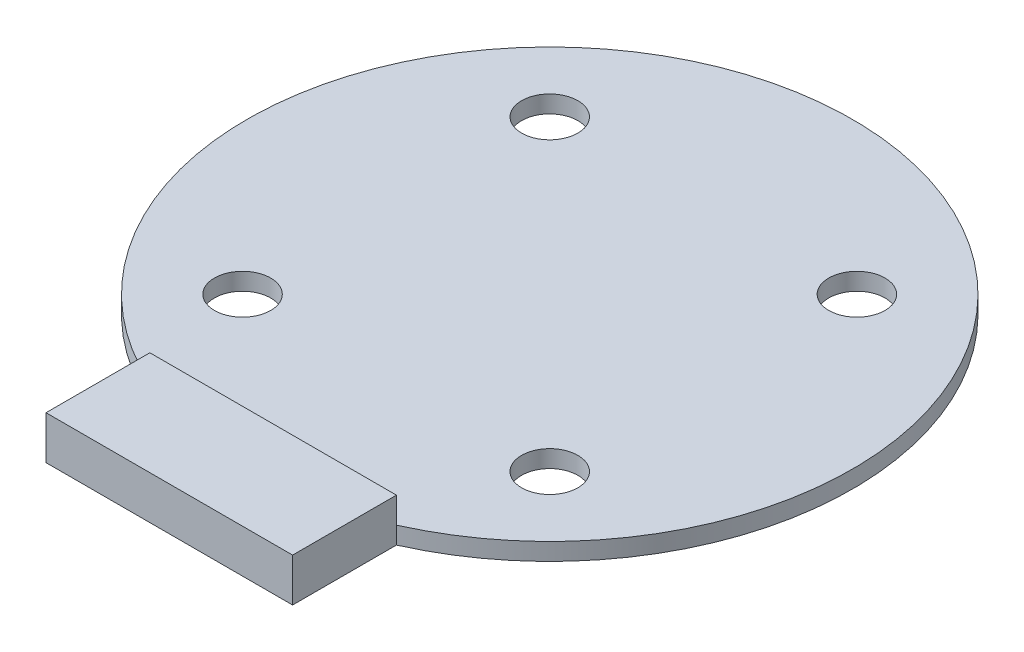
ISO-10303-21;
HEADER;
FILE_DESCRIPTION(('STEP AP214'),'2;1');
FILE_NAME('part.step','',(''),(''),'','','');
FILE_SCHEMA(('AUTOMOTIVE_DESIGN { 1 0 10303 214 1 1 1 1 }'));
ENDSEC;
DATA;
#1=APPLICATION_CONTEXT('core data for automotive mechanical design processes');
#2=APPLICATION_PROTOCOL_DEFINITION('international standard','automotive_design',2000,#1);
#3=PRODUCT_CONTEXT('',#1,'mechanical');
#4=PRODUCT('Part','Part','',(#3));
#5=PRODUCT_RELATED_PRODUCT_CATEGORY('part','',(#4));
#6=PRODUCT_DEFINITION_FORMATION('','',#4);
#7=PRODUCT_DEFINITION_CONTEXT('part definition',#1,'design');
#8=PRODUCT_DEFINITION('design','',#6,#7);
#9=PRODUCT_DEFINITION_SHAPE('','',#8);
#10=(LENGTH_UNIT() NAMED_UNIT(*) SI_UNIT(.MILLI.,.METRE.));
#11=(NAMED_UNIT(*) PLANE_ANGLE_UNIT() SI_UNIT($,.RADIAN.));
#12=(NAMED_UNIT(*) SI_UNIT($,.STERADIAN.) SOLID_ANGLE_UNIT());
#13=UNCERTAINTY_MEASURE_WITH_UNIT(LENGTH_MEASURE(1.E-05),#10,'distance_accuracy_value','');
#14=(GEOMETRIC_REPRESENTATION_CONTEXT(3) GLOBAL_UNCERTAINTY_ASSIGNED_CONTEXT((#13)) GLOBAL_UNIT_ASSIGNED_CONTEXT((#10,
#11,#12)) REPRESENTATION_CONTEXT('',''));
#15=CARTESIAN_POINT('',(0.,0.,0.));
#16=DIRECTION('',(0.,0.,1.));
#17=DIRECTION('',(1.,0.,0.));
#18=AXIS2_PLACEMENT_3D('',#15,#16,#17);
#19=CARTESIAN_POINT('',(0.,2.,0.));
#20=DIRECTION('',(0.,-1.,0.));
#21=DIRECTION('',(0.,0.,-1.));
#22=AXIS2_PLACEMENT_3D('',#19,#20,#21);
#23=CYLINDRICAL_SURFACE('',#22,35.);
#24=DIRECTION('',(0.,1.,0.));
#25=VECTOR('',#24,1.);
#26=CARTESIAN_POINT('',(-14.25,0.,31.9677571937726));
#27=LINE('',#26,#25);
#28=CARTESIAN_POINT('',(-14.25,0.,31.9677571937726));
#29=VERTEX_POINT('',#28);
#30=CARTESIAN_POINT('',(-14.25,2.,31.9677571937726));
#31=VERTEX_POINT('',#30);
#32=EDGE_CURVE('E94',#29,#31,#27,.T.);
#33=ORIENTED_EDGE('',*,*,#32,.T.);
#34=CARTESIAN_POINT('',(0.,2.,0.));
#35=DIRECTION('',(0.,1.,0.));
#36=DIRECTION('',(0.,0.,1.));
#37=AXIS2_PLACEMENT_3D('',#34,#35,#36);
#38=CIRCLE('',#37,35.);
#39=CARTESIAN_POINT('',(14.25,2.,31.9677571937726));
#40=VERTEX_POINT('',#39);
#41=EDGE_CURVE('E11',#40,#31,#38,.T.);
#42=ORIENTED_EDGE('',*,*,#41,.F.);
#43=DIRECTION('',(0.,1.,0.));
#44=VECTOR('',#43,1.);
#45=CARTESIAN_POINT('',(14.25,0.,31.9677571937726));
#46=LINE('',#45,#44);
#47=CARTESIAN_POINT('',(14.25,0.,31.9677571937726));
#48=VERTEX_POINT('',#47);
#49=EDGE_CURVE('E101',#48,#40,#46,.T.);
#50=ORIENTED_EDGE('',*,*,#49,.F.);
#51=CARTESIAN_POINT('',(0.,0.,0.));
#52=DIRECTION('',(0.,1.,0.));
#53=DIRECTION('',(0.,0.,1.));
#54=AXIS2_PLACEMENT_3D('',#51,#52,#53);
#55=CIRCLE('',#54,35.);
#56=EDGE_CURVE('E38',#48,#29,#55,.T.);
#57=ORIENTED_EDGE('',*,*,#56,.T.);
#58=EDGE_LOOP('',(#33,#42,#50,#57));
#59=FACE_BOUND('',#58,.T.);
#60=ADVANCED_FACE('F35',(#59),#23,.T.);
#61=CARTESIAN_POINT('',(0.,2.,0.));
#62=DIRECTION('',(0.,1.,0.));
#63=DIRECTION('',(0.,0.,1.));
#64=AXIS2_PLACEMENT_3D('',#61,#62,#63);
#65=PLANE('',#64);
#66=DIRECTION('',(-1.,0.,0.));
#67=VECTOR('',#66,1.);
#68=CARTESIAN_POINT('',(-14.25,2.,31.9677571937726));
#69=LINE('',#68,#67);
#70=EDGE_CURVE('E100',#40,#31,#69,.T.);
#71=ORIENTED_EDGE('',*,*,#70,.F.);
#72=ORIENTED_EDGE('',*,*,#41,.T.);
#73=EDGE_LOOP('',(#71,#72));
#74=FACE_BOUND('',#73,.T.);
#75=CARTESIAN_POINT('',(-17.75,2.,17.75));
#76=DIRECTION('',(0.,1.,0.));
#77=DIRECTION('',(0.,0.,1.));
#78=AXIS2_PLACEMENT_3D('',#75,#76,#77);
#79=CIRCLE('',#78,3.25);
#80=CARTESIAN_POINT('',(-17.75,2.,21.));
#81=VERTEX_POINT('',#80);
#82=EDGE_CURVE('E126',#81,#81,#79,.T.);
#83=ORIENTED_EDGE('',*,*,#82,.F.);
#84=EDGE_LOOP('',(#83));
#85=FACE_BOUND('',#84,.T.);
#86=CARTESIAN_POINT('',(17.75,2.,17.75));
#87=DIRECTION('',(0.,1.,0.));
#88=DIRECTION('',(0.,0.,1.));
#89=AXIS2_PLACEMENT_3D('',#86,#87,#88);
#90=CIRCLE('',#89,3.25);
#91=CARTESIAN_POINT('',(17.75,2.,21.));
#92=VERTEX_POINT('',#91);
#93=EDGE_CURVE('E120',#92,#92,#90,.T.);
#94=ORIENTED_EDGE('',*,*,#93,.F.);
#95=EDGE_LOOP('',(#94));
#96=FACE_BOUND('',#95,.T.);
#97=CARTESIAN_POINT('',(17.75,2.,-17.75));
#98=DIRECTION('',(0.,1.,0.));
#99=DIRECTION('',(0.,0.,1.));
#100=AXIS2_PLACEMENT_3D('',#97,#98,#99);
#101=CIRCLE('',#100,3.25);
#102=CARTESIAN_POINT('',(17.75,2.,-14.5));
#103=VERTEX_POINT('',#102);
#104=EDGE_CURVE('E114',#103,#103,#101,.T.);
#105=ORIENTED_EDGE('',*,*,#104,.F.);
#106=EDGE_LOOP('',(#105));
#107=FACE_BOUND('',#106,.T.);
#108=CARTESIAN_POINT('',(-17.75,2.,-17.75));
#109=DIRECTION('',(0.,1.,0.));
#110=DIRECTION('',(0.,0.,1.));
#111=AXIS2_PLACEMENT_3D('',#108,#109,#110);
#112=CIRCLE('',#111,3.25);
#113=CARTESIAN_POINT('',(-17.75,2.,-14.5));
#114=VERTEX_POINT('',#113);
#115=EDGE_CURVE('E106',#114,#114,#112,.T.);
#116=ORIENTED_EDGE('',*,*,#115,.F.);
#117=EDGE_LOOP('',(#116));
#118=FACE_BOUND('',#117,.T.);
#119=ADVANCED_FACE('F164',(#74,#85,#96,#107,#118),#65,.T.);
#120=CARTESIAN_POINT('',(0.,0.,0.));
#121=DIRECTION('',(0.,1.,0.));
#122=DIRECTION('',(0.,0.,1.));
#123=AXIS2_PLACEMENT_3D('',#120,#121,#122);
#124=PLANE('',#123);
#125=CARTESIAN_POINT('',(-17.75,0.,17.75));
#126=DIRECTION('',(0.,1.,0.));
#127=DIRECTION('',(0.,0.,1.));
#128=AXIS2_PLACEMENT_3D('',#125,#126,#127);
#129=CIRCLE('',#128,3.25);
#130=CARTESIAN_POINT('',(-17.75,0.,21.));
#131=VERTEX_POINT('',#130);
#132=EDGE_CURVE('E123',#131,#131,#129,.T.);
#133=ORIENTED_EDGE('',*,*,#132,.T.);
#134=EDGE_LOOP('',(#133));
#135=FACE_BOUND('',#134,.T.);
#136=CARTESIAN_POINT('',(17.75,0.,17.75));
#137=DIRECTION('',(0.,1.,0.));
#138=DIRECTION('',(0.,0.,1.));
#139=AXIS2_PLACEMENT_3D('',#136,#137,#138);
#140=CIRCLE('',#139,3.25);
#141=CARTESIAN_POINT('',(17.75,0.,21.));
#142=VERTEX_POINT('',#141);
#143=EDGE_CURVE('E117',#142,#142,#140,.T.);
#144=ORIENTED_EDGE('',*,*,#143,.T.);
#145=EDGE_LOOP('',(#144));
#146=FACE_BOUND('',#145,.T.);
#147=CARTESIAN_POINT('',(17.75,0.,-17.75));
#148=DIRECTION('',(0.,1.,0.));
#149=DIRECTION('',(0.,0.,1.));
#150=AXIS2_PLACEMENT_3D('',#147,#148,#149);
#151=CIRCLE('',#150,3.25);
#152=CARTESIAN_POINT('',(17.75,0.,-14.5));
#153=VERTEX_POINT('',#152);
#154=EDGE_CURVE('E111',#153,#153,#151,.T.);
#155=ORIENTED_EDGE('',*,*,#154,.T.);
#156=EDGE_LOOP('',(#155));
#157=FACE_BOUND('',#156,.T.);
#158=CARTESIAN_POINT('',(-17.75,0.,-17.75));
#159=DIRECTION('',(0.,1.,0.));
#160=DIRECTION('',(0.,0.,1.));
#161=AXIS2_PLACEMENT_3D('',#158,#159,#160);
#162=CIRCLE('',#161,3.25);
#163=CARTESIAN_POINT('',(-17.75,0.,-14.5));
#164=VERTEX_POINT('',#163);
#165=EDGE_CURVE('E104',#164,#164,#162,.T.);
#166=ORIENTED_EDGE('',*,*,#165,.T.);
#167=EDGE_LOOP('',(#166));
#168=FACE_BOUND('',#167,.T.);
#169=ORIENTED_EDGE('',*,*,#56,.F.);
#170=DIRECTION('',(0.,0.,1.));
#171=VECTOR('',#170,1.);
#172=CARTESIAN_POINT('',(14.25,0.,43.9677571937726));
#173=LINE('',#172,#171);
#174=CARTESIAN_POINT('',(14.25,0.,43.9677571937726));
#175=VERTEX_POINT('',#174);
#176=EDGE_CURVE('E91',#48,#175,#173,.T.);
#177=ORIENTED_EDGE('',*,*,#176,.T.);
#178=DIRECTION('',(-1.,0.,0.));
#179=VECTOR('',#178,1.);
#180=CARTESIAN_POINT('',(-14.25,0.,43.9677571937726));
#181=LINE('',#180,#179);
#182=CARTESIAN_POINT('',(-14.25,0.,43.9677571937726));
#183=VERTEX_POINT('',#182);
#184=EDGE_CURVE('E88',#175,#183,#181,.T.);
#185=ORIENTED_EDGE('',*,*,#184,.T.);
#186=DIRECTION('',(0.,0.,-1.));
#187=VECTOR('',#186,1.);
#188=CARTESIAN_POINT('',(-14.25,0.,43.9677571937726));
#189=LINE('',#188,#187);
#190=EDGE_CURVE('E82',#183,#29,#189,.T.);
#191=ORIENTED_EDGE('',*,*,#190,.T.);
#192=EDGE_LOOP('',(#169,#177,#185,#191));
#193=FACE_BOUND('',#192,.T.);
#194=ADVANCED_FACE('F84',(#135,#146,#157,#168,#193),#124,.F.);
#195=CARTESIAN_POINT('',(-17.75,0.,-17.75));
#196=DIRECTION('',(0.,1.,0.));
#197=DIRECTION('',(0.,0.,1.));
#198=AXIS2_PLACEMENT_3D('',#195,#196,#197);
#199=CYLINDRICAL_SURFACE('',#198,3.25);
#200=ORIENTED_EDGE('',*,*,#165,.F.);
#201=EDGE_LOOP('',(#200));
#202=FACE_BOUND('',#201,.T.);
#203=ORIENTED_EDGE('',*,*,#115,.T.);
#204=EDGE_LOOP('',(#203));
#205=FACE_BOUND('',#204,.T.);
#206=ADVANCED_FACE('F175',(#202,#205),#199,.F.);
#207=CARTESIAN_POINT('',(17.75,0.,-17.75));
#208=DIRECTION('',(0.,1.,0.));
#209=DIRECTION('',(0.,0.,1.));
#210=AXIS2_PLACEMENT_3D('',#207,#208,#209);
#211=CYLINDRICAL_SURFACE('',#210,3.25);
#212=ORIENTED_EDGE('',*,*,#154,.F.);
#213=EDGE_LOOP('',(#212));
#214=FACE_BOUND('',#213,.T.);
#215=ORIENTED_EDGE('',*,*,#104,.T.);
#216=EDGE_LOOP('',(#215));
#217=FACE_BOUND('',#216,.T.);
#218=ADVANCED_FACE('F182',(#214,#217),#211,.F.);
#219=CARTESIAN_POINT('',(17.75,0.,17.75));
#220=DIRECTION('',(0.,1.,0.));
#221=DIRECTION('',(0.,0.,1.));
#222=AXIS2_PLACEMENT_3D('',#219,#220,#221);
#223=CYLINDRICAL_SURFACE('',#222,3.25);
#224=ORIENTED_EDGE('',*,*,#143,.F.);
#225=EDGE_LOOP('',(#224));
#226=FACE_BOUND('',#225,.T.);
#227=ORIENTED_EDGE('',*,*,#93,.T.);
#228=EDGE_LOOP('',(#227));
#229=FACE_BOUND('',#228,.T.);
#230=ADVANCED_FACE('F186',(#226,#229),#223,.F.);
#231=CARTESIAN_POINT('',(-17.75,0.,17.75));
#232=DIRECTION('',(0.,1.,0.));
#233=DIRECTION('',(0.,0.,1.));
#234=AXIS2_PLACEMENT_3D('',#231,#232,#233);
#235=CYLINDRICAL_SURFACE('',#234,3.25);
#236=ORIENTED_EDGE('',*,*,#132,.F.);
#237=EDGE_LOOP('',(#236));
#238=FACE_BOUND('',#237,.T.);
#239=ORIENTED_EDGE('',*,*,#82,.T.);
#240=EDGE_LOOP('',(#239));
#241=FACE_BOUND('',#240,.T.);
#242=ADVANCED_FACE('F190',(#238,#241),#235,.F.);
#243=CARTESIAN_POINT('',(-14.25,5.,43.9677571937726));
#244=DIRECTION('',(1.,0.,0.));
#245=DIRECTION('',(0.,0.,-1.));
#246=AXIS2_PLACEMENT_3D('',#243,#244,#245);
#247=PLANE('',#246);
#248=DIRECTION('',(0.,-1.,0.));
#249=VECTOR('',#248,1.);
#250=CARTESIAN_POINT('',(-14.25,5.,31.9677571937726));
#251=LINE('',#250,#249);
#252=CARTESIAN_POINT('',(-14.25,5.,31.9677571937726));
#253=VERTEX_POINT('',#252);
#254=EDGE_CURVE('E97',#253,#31,#251,.T.);
#255=ORIENTED_EDGE('',*,*,#254,.T.);
#256=ORIENTED_EDGE('',*,*,#32,.F.);
#257=ORIENTED_EDGE('',*,*,#190,.F.);
#258=DIRECTION('',(0.,-1.,0.));
#259=VECTOR('',#258,1.);
#260=CARTESIAN_POINT('',(-14.25,5.,43.9677571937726));
#261=LINE('',#260,#259);
#262=CARTESIAN_POINT('',(-14.25,5.,43.9677571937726));
#263=VERTEX_POINT('',#262);
#264=EDGE_CURVE('E129',#263,#183,#261,.T.);
#265=ORIENTED_EDGE('',*,*,#264,.F.);
#266=DIRECTION('',(0.,0.,1.));
#267=VECTOR('',#266,1.);
#268=CARTESIAN_POINT('',(-14.25,5.,43.9677571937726));
#269=LINE('',#268,#267);
#270=EDGE_CURVE('E141',#253,#263,#269,.T.);
#271=ORIENTED_EDGE('',*,*,#270,.F.);
#272=EDGE_LOOP('',(#255,#256,#257,#265,#271));
#273=FACE_BOUND('',#272,.T.);
#274=ADVANCED_FACE('F95',(#273),#247,.F.);
#275=CARTESIAN_POINT('',(14.25,5.,43.9677571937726));
#276=DIRECTION('',(0.,0.,-1.));
#277=DIRECTION('',(-1.,0.,0.));
#278=AXIS2_PLACEMENT_3D('',#275,#276,#277);
#279=PLANE('',#278);
#280=ORIENTED_EDGE('',*,*,#264,.T.);
#281=ORIENTED_EDGE('',*,*,#184,.F.);
#282=DIRECTION('',(0.,-1.,0.));
#283=VECTOR('',#282,1.);
#284=CARTESIAN_POINT('',(14.25,5.,43.9677571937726));
#285=LINE('',#284,#283);
#286=CARTESIAN_POINT('',(14.25,5.,43.9677571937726));
#287=VERTEX_POINT('',#286);
#288=EDGE_CURVE('E133',#287,#175,#285,.T.);
#289=ORIENTED_EDGE('',*,*,#288,.F.);
#290=DIRECTION('',(1.,0.,0.));
#291=VECTOR('',#290,1.);
#292=CARTESIAN_POINT('',(14.25,5.,43.9677571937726));
#293=LINE('',#292,#291);
#294=EDGE_CURVE('E144',#263,#287,#293,.T.);
#295=ORIENTED_EDGE('',*,*,#294,.F.);
#296=EDGE_LOOP('',(#280,#281,#289,#295));
#297=FACE_BOUND('',#296,.T.);
#298=ADVANCED_FACE('F152',(#297),#279,.F.);
#299=CARTESIAN_POINT('',(14.25,5.,31.9677571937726));
#300=DIRECTION('',(-1.,0.,0.));
#301=DIRECTION('',(0.,0.,1.));
#302=AXIS2_PLACEMENT_3D('',#299,#300,#301);
#303=PLANE('',#302);
#304=ORIENTED_EDGE('',*,*,#288,.T.);
#305=ORIENTED_EDGE('',*,*,#176,.F.);
#306=ORIENTED_EDGE('',*,*,#49,.T.);
#307=DIRECTION('',(0.,-1.,0.));
#308=VECTOR('',#307,1.);
#309=CARTESIAN_POINT('',(14.25,5.,31.9677571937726));
#310=LINE('',#309,#308);
#311=CARTESIAN_POINT('',(14.25,5.,31.9677571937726));
#312=VERTEX_POINT('',#311);
#313=EDGE_CURVE('E135',#312,#40,#310,.T.);
#314=ORIENTED_EDGE('',*,*,#313,.F.);
#315=DIRECTION('',(0.,0.,-1.));
#316=VECTOR('',#315,1.);
#317=CARTESIAN_POINT('',(14.25,5.,31.9677571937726));
#318=LINE('',#317,#316);
#319=EDGE_CURVE('E54',#287,#312,#318,.T.);
#320=ORIENTED_EDGE('',*,*,#319,.F.);
#321=EDGE_LOOP('',(#304,#305,#306,#314,#320));
#322=FACE_BOUND('',#321,.T.);
#323=ADVANCED_FACE('F160',(#322),#303,.F.);
#324=CARTESIAN_POINT('',(-14.25,5.,31.9677571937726));
#325=DIRECTION('',(0.,0.,1.));
#326=DIRECTION('',(1.,0.,0.));
#327=AXIS2_PLACEMENT_3D('',#324,#325,#326);
#328=PLANE('',#327);
#329=ORIENTED_EDGE('',*,*,#70,.T.);
#330=ORIENTED_EDGE('',*,*,#254,.F.);
#331=DIRECTION('',(-1.,0.,0.));
#332=VECTOR('',#331,1.);
#333=CARTESIAN_POINT('',(-14.25,5.,31.9677571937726));
#334=LINE('',#333,#332);
#335=EDGE_CURVE('E49',#312,#253,#334,.T.);
#336=ORIENTED_EDGE('',*,*,#335,.F.);
#337=ORIENTED_EDGE('',*,*,#313,.T.);
#338=EDGE_LOOP('',(#329,#330,#336,#337));
#339=FACE_BOUND('',#338,.T.);
#340=ADVANCED_FACE('F155',(#339),#328,.F.);
#341=CARTESIAN_POINT('',(0.,5.,0.));
#342=DIRECTION('',(0.,-1.,0.));
#343=DIRECTION('',(0.,0.,-1.));
#344=AXIS2_PLACEMENT_3D('',#341,#342,#343);
#345=PLANE('',#344);
#346=ORIENTED_EDGE('',*,*,#270,.T.);
#347=ORIENTED_EDGE('',*,*,#294,.T.);
#348=ORIENTED_EDGE('',*,*,#319,.T.);
#349=ORIENTED_EDGE('',*,*,#335,.T.);
#350=EDGE_LOOP('',(#346,#347,#348,#349));
#351=FACE_BOUND('',#350,.T.);
#352=ADVANCED_FACE('F153',(#351),#345,.F.);
#353=CLOSED_SHELL('',(#60,#119,#194,#206,#218,#230,#242,#274,#298,#323,#340,#352));
#354=MANIFOLD_SOLID_BREP('B2',#353);
#355=ADVANCED_BREP_SHAPE_REPRESENTATION('',(#18,#354),#14);
#356=SHAPE_DEFINITION_REPRESENTATION(#9,#355);
ENDSEC;
END-ISO-10303-21;
